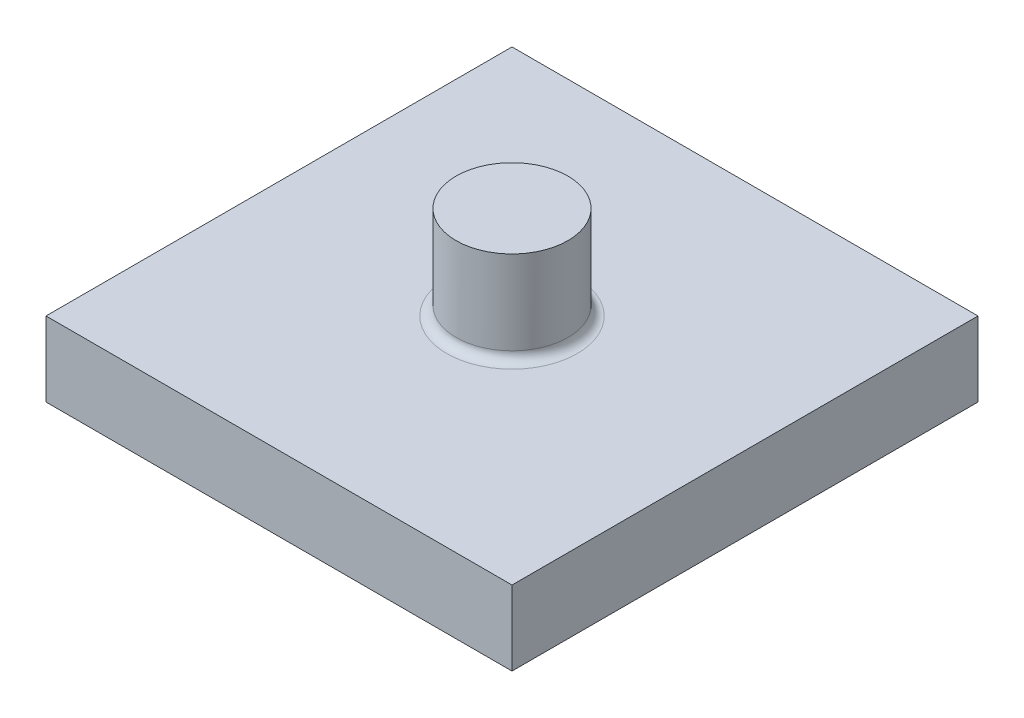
ISO-10303-21;
HEADER;
FILE_DESCRIPTION(('STEP AP214'),'2;1');
FILE_NAME('part.step','',(''),(''),'','','');
FILE_SCHEMA(('AUTOMOTIVE_DESIGN { 1 0 10303 214 1 1 1 1 }'));
ENDSEC;
DATA;
#1=APPLICATION_CONTEXT('core data for automotive mechanical design processes');
#2=APPLICATION_PROTOCOL_DEFINITION('international standard','automotive_design',2000,#1);
#3=PRODUCT_CONTEXT('',#1,'mechanical');
#4=PRODUCT('Part','Part','',(#3));
#5=PRODUCT_RELATED_PRODUCT_CATEGORY('part','',(#4));
#6=PRODUCT_DEFINITION_FORMATION('','',#4);
#7=PRODUCT_DEFINITION_CONTEXT('part definition',#1,'design');
#8=PRODUCT_DEFINITION('design','',#6,#7);
#9=PRODUCT_DEFINITION_SHAPE('','',#8);
#10=(LENGTH_UNIT() NAMED_UNIT(*) SI_UNIT(.MILLI.,.METRE.));
#11=(NAMED_UNIT(*) PLANE_ANGLE_UNIT() SI_UNIT($,.RADIAN.));
#12=(NAMED_UNIT(*) SI_UNIT($,.STERADIAN.) SOLID_ANGLE_UNIT());
#13=UNCERTAINTY_MEASURE_WITH_UNIT(LENGTH_MEASURE(1.E-05),#10,'distance_accuracy_value','');
#14=(GEOMETRIC_REPRESENTATION_CONTEXT(3) GLOBAL_UNCERTAINTY_ASSIGNED_CONTEXT((#13)) GLOBAL_UNIT_ASSIGNED_CONTEXT((#10,
#11,#12)) REPRESENTATION_CONTEXT('',''));
#15=CARTESIAN_POINT('',(0.,0.,0.));
#16=DIRECTION('',(0.,0.,1.));
#17=DIRECTION('',(1.,0.,0.));
#18=AXIS2_PLACEMENT_3D('',#15,#16,#17);
#19=CARTESIAN_POINT('',(12.5,4.,12.5));
#20=DIRECTION('',(-1.,0.,0.));
#21=DIRECTION('',(0.,0.,1.));
#22=AXIS2_PLACEMENT_3D('',#19,#20,#21);
#23=PLANE('',#22);
#24=DIRECTION('',(0.,0.,-1.));
#25=VECTOR('',#24,1.);
#26=CARTESIAN_POINT('',(12.5,0.,12.5));
#27=LINE('',#26,#25);
#28=CARTESIAN_POINT('',(12.5,0.,12.5));
#29=VERTEX_POINT('',#28);
#30=CARTESIAN_POINT('',(12.5,0.,-12.5));
#31=VERTEX_POINT('',#30);
#32=EDGE_CURVE('E101',#29,#31,#27,.T.);
#33=ORIENTED_EDGE('',*,*,#32,.T.);
#34=DIRECTION('',(0.,-1.,0.));
#35=VECTOR('',#34,1.);
#36=CARTESIAN_POINT('',(12.5,4.,-12.5));
#37=LINE('',#36,#35);
#38=CARTESIAN_POINT('',(12.5,4.,-12.5));
#39=VERTEX_POINT('',#38);
#40=EDGE_CURVE('E92',#39,#31,#37,.T.);
#41=ORIENTED_EDGE('',*,*,#40,.F.);
#42=DIRECTION('',(0.,0.,-1.));
#43=VECTOR('',#42,1.);
#44=CARTESIAN_POINT('',(12.5,4.,12.5));
#45=LINE('',#44,#43);
#46=CARTESIAN_POINT('',(12.5,4.,12.5));
#47=VERTEX_POINT('',#46);
#48=EDGE_CURVE('E86',#47,#39,#45,.T.);
#49=ORIENTED_EDGE('',*,*,#48,.F.);
#50=DIRECTION('',(0.,-1.,0.));
#51=VECTOR('',#50,1.);
#52=CARTESIAN_POINT('',(12.5,4.,12.5));
#53=LINE('',#52,#51);
#54=EDGE_CURVE('E97',#47,#29,#53,.T.);
#55=ORIENTED_EDGE('',*,*,#54,.T.);
#56=EDGE_LOOP('',(#33,#41,#49,#55));
#57=FACE_BOUND('',#56,.T.);
#58=ADVANCED_FACE('F33',(#57),#23,.F.);
#59=CARTESIAN_POINT('',(-12.5,4.,-12.5));
#60=DIRECTION('',(0.,0.,1.));
#61=DIRECTION('',(1.,0.,0.));
#62=AXIS2_PLACEMENT_3D('',#59,#60,#61);
#63=PLANE('',#62);
#64=DIRECTION('',(-1.,0.,0.));
#65=VECTOR('',#64,1.);
#66=CARTESIAN_POINT('',(-12.5,0.,-12.5));
#67=LINE('',#66,#65);
#68=CARTESIAN_POINT('',(-12.5,0.,-12.5));
#69=VERTEX_POINT('',#68);
#70=EDGE_CURVE('E91',#31,#69,#67,.T.);
#71=ORIENTED_EDGE('',*,*,#70,.T.);
#72=DIRECTION('',(0.,-1.,0.));
#73=VECTOR('',#72,1.);
#74=CARTESIAN_POINT('',(-12.5,4.,-12.5));
#75=LINE('',#74,#73);
#76=CARTESIAN_POINT('',(-12.5,4.,-12.5));
#77=VERTEX_POINT('',#76);
#78=EDGE_CURVE('E89',#77,#69,#75,.T.);
#79=ORIENTED_EDGE('',*,*,#78,.F.);
#80=DIRECTION('',(-1.,0.,0.));
#81=VECTOR('',#80,1.);
#82=CARTESIAN_POINT('',(-12.5,4.,-12.5));
#83=LINE('',#82,#81);
#84=EDGE_CURVE('E81',#39,#77,#83,.T.);
#85=ORIENTED_EDGE('',*,*,#84,.F.);
#86=ORIENTED_EDGE('',*,*,#40,.T.);
#87=EDGE_LOOP('',(#71,#79,#85,#86));
#88=FACE_BOUND('',#87,.T.);
#89=ADVANCED_FACE('F90',(#88),#63,.F.);
#90=CARTESIAN_POINT('',(-12.5,4.,12.5));
#91=DIRECTION('',(1.,0.,0.));
#92=DIRECTION('',(0.,0.,-1.));
#93=AXIS2_PLACEMENT_3D('',#90,#91,#92);
#94=PLANE('',#93);
#95=DIRECTION('',(0.,0.,1.));
#96=VECTOR('',#95,1.);
#97=CARTESIAN_POINT('',(-12.5,0.,12.5));
#98=LINE('',#97,#96);
#99=CARTESIAN_POINT('',(-12.5,0.,12.5));
#100=VERTEX_POINT('',#99);
#101=EDGE_CURVE('E67',#69,#100,#98,.T.);
#102=ORIENTED_EDGE('',*,*,#101,.T.);
#103=DIRECTION('',(0.,-1.,0.));
#104=VECTOR('',#103,1.);
#105=CARTESIAN_POINT('',(-12.5,4.,12.5));
#106=LINE('',#105,#104);
#107=CARTESIAN_POINT('',(-12.5,4.,12.5));
#108=VERTEX_POINT('',#107);
#109=EDGE_CURVE('E93',#108,#100,#106,.T.);
#110=ORIENTED_EDGE('',*,*,#109,.F.);
#111=DIRECTION('',(0.,0.,1.));
#112=VECTOR('',#111,1.);
#113=CARTESIAN_POINT('',(-12.5,4.,12.5));
#114=LINE('',#113,#112);
#115=EDGE_CURVE('E84',#77,#108,#114,.T.);
#116=ORIENTED_EDGE('',*,*,#115,.F.);
#117=ORIENTED_EDGE('',*,*,#78,.T.);
#118=EDGE_LOOP('',(#102,#110,#116,#117));
#119=FACE_BOUND('',#118,.T.);
#120=ADVANCED_FACE('F95',(#119),#94,.F.);
#121=CARTESIAN_POINT('',(-12.5,4.,12.5));
#122=DIRECTION('',(0.,0.,-1.));
#123=DIRECTION('',(-1.,0.,0.));
#124=AXIS2_PLACEMENT_3D('',#121,#122,#123);
#125=PLANE('',#124);
#126=DIRECTION('',(1.,0.,0.));
#127=VECTOR('',#126,1.);
#128=CARTESIAN_POINT('',(-12.5,0.,12.5));
#129=LINE('',#128,#127);
#130=EDGE_CURVE('E73',#100,#29,#129,.T.);
#131=ORIENTED_EDGE('',*,*,#130,.T.);
#132=ORIENTED_EDGE('',*,*,#54,.F.);
#133=DIRECTION('',(1.,0.,0.));
#134=VECTOR('',#133,1.);
#135=CARTESIAN_POINT('',(-12.5,4.,12.5));
#136=LINE('',#135,#134);
#137=EDGE_CURVE('E50',#108,#47,#136,.T.);
#138=ORIENTED_EDGE('',*,*,#137,.F.);
#139=ORIENTED_EDGE('',*,*,#109,.T.);
#140=EDGE_LOOP('',(#131,#132,#138,#139));
#141=FACE_BOUND('',#140,.T.);
#142=ADVANCED_FACE('F134',(#141),#125,.F.);
#143=CARTESIAN_POINT('',(0.,4.,0.));
#144=DIRECTION('',(0.,-1.,0.));
#145=DIRECTION('',(0.,0.,-1.));
#146=AXIS2_PLACEMENT_3D('',#143,#144,#145);
#147=PLANE('',#146);
#148=CARTESIAN_POINT('',(0.,4.,0.));
#149=DIRECTION('',(0.,-1.,0.));
#150=DIRECTION('',(0.,0.,-1.));
#151=AXIS2_PLACEMENT_3D('',#148,#149,#150);
#152=CIRCLE('',#151,3.5);
#153=CARTESIAN_POINT('',(0.,4.,-3.5));
#154=VERTEX_POINT('',#153);
#155=EDGE_CURVE('E11',#154,#154,#152,.T.);
#156=ORIENTED_EDGE('',*,*,#155,.T.);
#157=EDGE_LOOP('',(#156));
#158=FACE_BOUND('',#157,.T.);
#159=ORIENTED_EDGE('',*,*,#48,.T.);
#160=ORIENTED_EDGE('',*,*,#84,.T.);
#161=ORIENTED_EDGE('',*,*,#115,.T.);
#162=ORIENTED_EDGE('',*,*,#137,.T.);
#163=EDGE_LOOP('',(#159,#160,#161,#162));
#164=FACE_BOUND('',#163,.T.);
#165=ADVANCED_FACE('F82',(#158,#164),#147,.F.);
#166=CARTESIAN_POINT('',(0.,0.,0.));
#167=DIRECTION('',(0.,-1.,0.));
#168=DIRECTION('',(0.,0.,-1.));
#169=AXIS2_PLACEMENT_3D('',#166,#167,#168);
#170=PLANE('',#169);
#171=ORIENTED_EDGE('',*,*,#32,.F.);
#172=ORIENTED_EDGE('',*,*,#130,.F.);
#173=ORIENTED_EDGE('',*,*,#101,.F.);
#174=ORIENTED_EDGE('',*,*,#70,.F.);
#175=EDGE_LOOP('',(#171,#172,#173,#174));
#176=FACE_BOUND('',#175,.T.);
#177=ADVANCED_FACE('F137',(#176),#170,.T.);
#178=CARTESIAN_POINT('',(0.,9.,0.));
#179=DIRECTION('',(0.,-1.,0.));
#180=DIRECTION('',(0.,0.,-1.));
#181=AXIS2_PLACEMENT_3D('',#178,#179,#180);
#182=CYLINDRICAL_SURFACE('',#181,3.);
#183=CARTESIAN_POINT('',(0.,4.5,0.));
#184=DIRECTION('',(0.,-1.,0.));
#185=DIRECTION('',(0.,0.,-1.));
#186=AXIS2_PLACEMENT_3D('',#183,#184,#185);
#187=CIRCLE('',#186,3.);
#188=CARTESIAN_POINT('',(0.,4.5,-3.));
#189=VERTEX_POINT('',#188);
#190=EDGE_CURVE('E42',#189,#189,#187,.F.);
#191=ORIENTED_EDGE('',*,*,#190,.T.);
#192=EDGE_LOOP('',(#191));
#193=FACE_BOUND('',#192,.T.);
#194=CARTESIAN_POINT('',(0.,9.,0.));
#195=DIRECTION('',(0.,1.,0.));
#196=DIRECTION('',(0.,0.,1.));
#197=AXIS2_PLACEMENT_3D('',#194,#195,#196);
#198=CIRCLE('',#197,3.);
#199=CARTESIAN_POINT('',(0.,9.,3.));
#200=VERTEX_POINT('',#199);
#201=EDGE_CURVE('E104',#200,#200,#198,.T.);
#202=ORIENTED_EDGE('',*,*,#201,.F.);
#203=EDGE_LOOP('',(#202));
#204=FACE_BOUND('',#203,.T.);
#205=ADVANCED_FACE('F113',(#193,#204),#182,.T.);
#206=CARTESIAN_POINT('',(0.,9.,0.));
#207=DIRECTION('',(0.,1.,0.));
#208=DIRECTION('',(0.,0.,1.));
#209=AXIS2_PLACEMENT_3D('',#206,#207,#208);
#210=PLANE('',#209);
#211=ORIENTED_EDGE('',*,*,#201,.T.);
#212=EDGE_LOOP('',(#211));
#213=FACE_BOUND('',#212,.T.);
#214=ADVANCED_FACE('F117',(#213),#210,.T.);
#215=CARTESIAN_POINT('',(0.,4.5,0.));
#216=DIRECTION('',(0.,-1.,0.));
#217=DIRECTION('',(0.,0.,-1.));
#218=AXIS2_PLACEMENT_3D('',#215,#216,#217);
#219=TOROIDAL_SURFACE('',#218,3.5,0.5);
#220=ORIENTED_EDGE('',*,*,#155,.F.);
#221=EDGE_LOOP('',(#220));
#222=FACE_BOUND('',#221,.T.);
#223=ORIENTED_EDGE('',*,*,#190,.F.);
#224=EDGE_LOOP('',(#223));
#225=FACE_BOUND('',#224,.T.);
#226=ADVANCED_FACE('F35',(#222,#225),#219,.F.);
#227=CLOSED_SHELL('',(#58,#89,#120,#142,#165,#177,#205,#214,#226));
#228=MANIFOLD_SOLID_BREP('B2',#227);
#229=ADVANCED_BREP_SHAPE_REPRESENTATION('',(#18,#228),#14);
#230=SHAPE_DEFINITION_REPRESENTATION(#9,#229);
ENDSEC;
END-ISO-10303-21;
